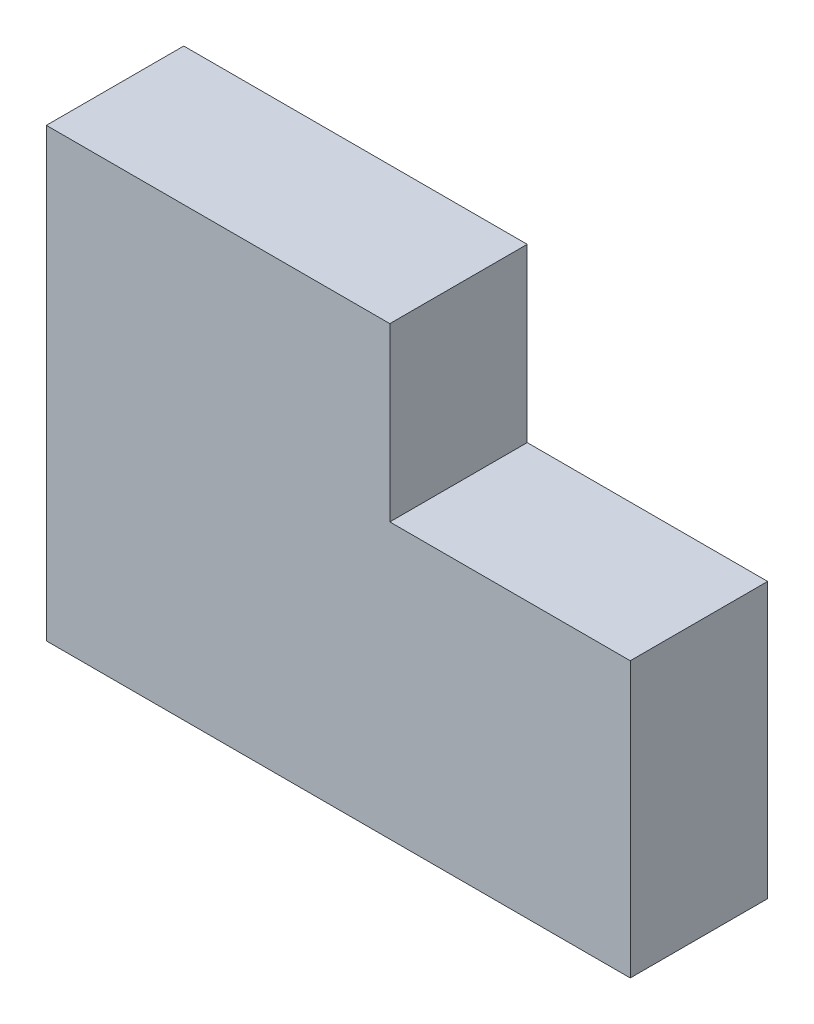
from build123d import *

# Parameters (mm, degrees)
EXTRUDE1_DEPTH = 20


with BuildPart() as part:
    # Sketch1 → Extrude1 (new body)
    with BuildSketch(Plane.XY):
        Polygon((0, 0), (85, 0), (85, 40), (50, 40), (50, 65), (0, 65), align=None)
    extrude(amount=EXTRUDE1_DEPTH)


solid = part.part
